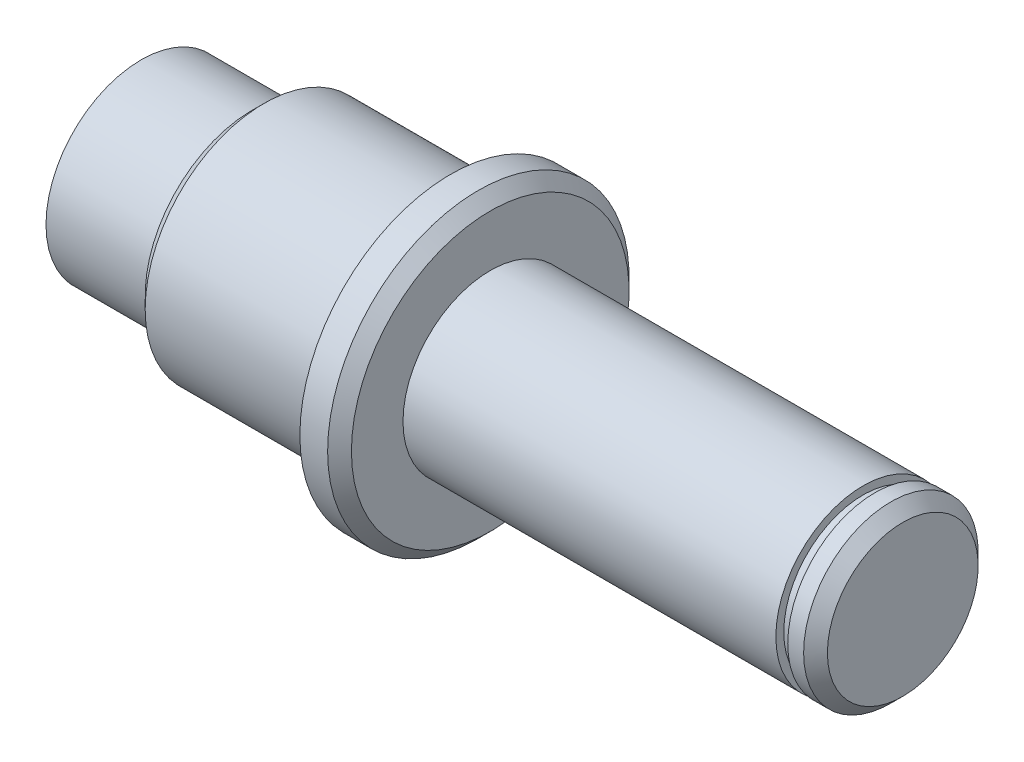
ISO-10303-21;
HEADER;
FILE_DESCRIPTION(('STEP AP214'),'2;1');
FILE_NAME('part.step','',(''),(''),'','','');
FILE_SCHEMA(('AUTOMOTIVE_DESIGN { 1 0 10303 214 1 1 1 1 }'));
ENDSEC;
DATA;
#1=APPLICATION_CONTEXT('core data for automotive mechanical design processes');
#2=APPLICATION_PROTOCOL_DEFINITION('international standard','automotive_design',2000,#1);
#3=PRODUCT_CONTEXT('',#1,'mechanical');
#4=PRODUCT('Part','Part','',(#3));
#5=PRODUCT_RELATED_PRODUCT_CATEGORY('part','',(#4));
#6=PRODUCT_DEFINITION_FORMATION('','',#4);
#7=PRODUCT_DEFINITION_CONTEXT('part definition',#1,'design');
#8=PRODUCT_DEFINITION('design','',#6,#7);
#9=PRODUCT_DEFINITION_SHAPE('','',#8);
#10=(LENGTH_UNIT() NAMED_UNIT(*) SI_UNIT(.MILLI.,.METRE.));
#11=(NAMED_UNIT(*) PLANE_ANGLE_UNIT() SI_UNIT($,.RADIAN.));
#12=(NAMED_UNIT(*) SI_UNIT($,.STERADIAN.) SOLID_ANGLE_UNIT());
#13=UNCERTAINTY_MEASURE_WITH_UNIT(LENGTH_MEASURE(1.E-05),#10,'distance_accuracy_value','');
#14=(GEOMETRIC_REPRESENTATION_CONTEXT(3) GLOBAL_UNCERTAINTY_ASSIGNED_CONTEXT((#13)) GLOBAL_UNIT_ASSIGNED_CONTEXT((#10,
#11,#12)) REPRESENTATION_CONTEXT('',''));
#15=CARTESIAN_POINT('',(0.,0.,0.));
#16=DIRECTION('',(0.,0.,1.));
#17=DIRECTION('',(1.,0.,0.));
#18=AXIS2_PLACEMENT_3D('',#15,#16,#17);
#19=CARTESIAN_POINT('',(0.,0.,0.));
#20=DIRECTION('',(-1.,0.,0.));
#21=DIRECTION('',(0.,0.,1.));
#22=AXIS2_PLACEMENT_3D('',#19,#20,#21);
#23=CYLINDRICAL_SURFACE('',#22,11.);
#24=CARTESIAN_POINT('',(47.0000000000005,0.,0.));
#25=DIRECTION('',(-1.,0.,0.));
#26=DIRECTION('',(0.,0.,1.));
#27=AXIS2_PLACEMENT_3D('',#24,#25,#26);
#28=CIRCLE('',#27,11.);
#29=CARTESIAN_POINT('',(47.0000000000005,0.,11.));
#30=VERTEX_POINT('',#29);
#31=EDGE_CURVE('E119',#30,#30,#28,.T.);
#32=ORIENTED_EDGE('',*,*,#31,.F.);
#33=EDGE_LOOP('',(#32));
#34=FACE_BOUND('',#33,.T.);
#35=CARTESIAN_POINT('',(94.0000000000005,0.,0.));
#36=DIRECTION('',(-1.,0.,0.));
#37=DIRECTION('',(0.,0.,1.));
#38=AXIS2_PLACEMENT_3D('',#35,#36,#37);
#39=CIRCLE('',#38,11.);
#40=CARTESIAN_POINT('',(94.0000000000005,0.,11.));
#41=VERTEX_POINT('',#40);
#42=EDGE_CURVE('E120',#41,#41,#39,.T.);
#43=ORIENTED_EDGE('',*,*,#42,.T.);
#44=EDGE_LOOP('',(#43));
#45=FACE_BOUND('',#44,.T.);
#46=CARTESIAN_POINT('',(60.0000000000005,-10.5830052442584,-2.99999999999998));
#47=CARTESIAN_POINT('',(60.1651129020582,-10.583007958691,-2.99999631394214));
#48=CARTESIAN_POINT('',(60.3302642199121,-10.5869115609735,-2.98632243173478));
#49=CARTESIAN_POINT('',(60.6557870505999,-10.6020548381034,-2.93209821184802));
#50=CARTESIAN_POINT('',(60.8161562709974,-10.6132979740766,-2.89153519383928));
#51=CARTESIAN_POINT('',(61.1273583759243,-10.6417543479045,-2.78497349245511));
#52=CARTESIAN_POINT('',(61.278204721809,-10.6589589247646,-2.71901169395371));
#53=CARTESIAN_POINT('',(61.5667162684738,-10.6973885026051,-2.56364148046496));
#54=CARTESIAN_POINT('',(61.7043802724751,-10.7186138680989,-2.47423093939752));
#55=CARTESIAN_POINT('',(61.9662204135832,-10.7633157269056,-2.27199971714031));
#56=CARTESIAN_POINT('',(62.0900006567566,-10.786833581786,-2.15867548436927));
#57=CARTESIAN_POINT('',(62.3170553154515,-10.8331142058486,-1.91291605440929));
#58=CARTESIAN_POINT('',(62.4203275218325,-10.8558768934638,-1.78047880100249));
#59=CARTESIAN_POINT('',(62.6050972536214,-10.898545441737,-1.49749518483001));
#60=CARTESIAN_POINT('',(62.6861994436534,-10.9183968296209,-1.34668176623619));
#61=CARTESIAN_POINT('',(62.8217457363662,-10.9525304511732,-1.03292742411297));
#62=CARTESIAN_POINT('',(62.8761945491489,-10.9668136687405,-0.869988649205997));
#63=CARTESIAN_POINT('',(62.9556021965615,-10.9879091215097,-0.540742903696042));
#64=CARTESIAN_POINT('',(62.9812348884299,-10.994891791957,-0.374609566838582));
#65=CARTESIAN_POINT('',(63.0044046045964,-11.0011960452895,-0.040263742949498));
#66=CARTESIAN_POINT('',(63.0019465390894,-11.0005189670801,0.12794837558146));
#67=CARTESIAN_POINT('',(62.9694752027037,-10.9917041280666,0.456980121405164));
#68=CARTESIAN_POINT('',(62.940190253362,-10.9837635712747,0.617877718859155));
#69=CARTESIAN_POINT('',(62.8560753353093,-10.9615478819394,0.932382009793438));
#70=CARTESIAN_POINT('',(62.8012438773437,-10.9472723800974,1.08598827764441));
#71=CARTESIAN_POINT('',(62.6670457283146,-10.9137017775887,1.38338647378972));
#72=CARTESIAN_POINT('',(62.5874331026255,-10.8943566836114,1.52706155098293));
#73=CARTESIAN_POINT('',(62.4061222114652,-10.852725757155,1.79925853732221));
#74=CARTESIAN_POINT('',(62.3044194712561,-10.830439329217,1.92777736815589));
#75=CARTESIAN_POINT('',(62.0779640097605,-10.784492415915,2.17036149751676));
#76=CARTESIAN_POINT('',(61.9525766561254,-10.7608107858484,2.2838310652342));
#77=CARTESIAN_POINT('',(61.6843095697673,-10.7153839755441,2.48828152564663));
#78=CARTESIAN_POINT('',(61.5414286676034,-10.6936389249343,2.5792609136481));
#79=CARTESIAN_POINT('',(61.2408912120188,-10.6544594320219,2.73663009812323));
#80=CARTESIAN_POINT('',(61.0831419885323,-10.6370548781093,2.8028508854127));
#81=CARTESIAN_POINT('',(60.7581547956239,-10.6088947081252,2.9076329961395));
#82=CARTESIAN_POINT('',(60.5909193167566,-10.5981373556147,2.94620154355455));
#83=CARTESIAN_POINT('',(60.257295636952,-10.5848615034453,2.99354252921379));
#84=CARTESIAN_POINT('',(60.0910436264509,-10.5820965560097,3.00320658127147));
#85=CARTESIAN_POINT('',(59.7592977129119,-10.5844430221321,2.99492665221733));
#86=CARTESIAN_POINT('',(59.5938037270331,-10.5895535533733,2.97698576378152));
#87=CARTESIAN_POINT('',(59.2717551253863,-10.6068364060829,2.91479275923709));
#88=CARTESIAN_POINT('',(59.1150871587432,-10.6188630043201,2.87108313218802));
#89=CARTESIAN_POINT('',(58.811307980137,-10.6484790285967,2.75920663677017));
#90=CARTESIAN_POINT('',(58.6641980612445,-10.6660692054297,2.69103646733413));
#91=CARTESIAN_POINT('',(58.3799985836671,-10.7053313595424,2.53038481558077));
#92=CARTESIAN_POINT('',(58.2432148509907,-10.7270874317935,2.43738334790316));
#93=CARTESIAN_POINT('',(57.9868678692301,-10.7720352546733,2.23034883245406));
#94=CARTESIAN_POINT('',(57.8673080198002,-10.7952272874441,2.1163116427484));
#95=CARTESIAN_POINT('',(57.6450672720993,-10.8412873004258,1.86630672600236));
#96=CARTESIAN_POINT('',(57.5430099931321,-10.8641239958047,1.72977769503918));
#97=CARTESIAN_POINT('',(57.3632587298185,-10.9061791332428,1.44101111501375));
#98=CARTESIAN_POINT('',(57.2855634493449,-10.9253977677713,1.28877440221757));
#99=CARTESIAN_POINT('',(57.1574658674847,-10.9579274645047,0.973984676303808));
#100=CARTESIAN_POINT('',(57.1068582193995,-10.9712828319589,0.81152002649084));
#101=CARTESIAN_POINT('',(57.0337860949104,-10.9907764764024,0.479971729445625));
#102=CARTESIAN_POINT('',(57.0113150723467,-10.9969164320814,0.310889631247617));
#103=CARTESIAN_POINT('',(56.9955797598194,-11.0012041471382,-0.0232794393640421));
#104=CARTESIAN_POINT('',(57.0014026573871,-10.9996016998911,-0.188320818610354));
#105=CARTESIAN_POINT('',(57.0399595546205,-10.9891537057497,-0.514982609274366));
#106=CARTESIAN_POINT('',(57.0726924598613,-10.980308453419,-0.676603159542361));
#107=CARTESIAN_POINT('',(57.1636147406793,-10.9564222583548,-0.99068406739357));
#108=CARTESIAN_POINT('',(57.2216113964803,-10.9414282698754,-1.14320402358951));
#109=CARTESIAN_POINT('',(57.3612432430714,-10.9068088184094,-1.43643473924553));
#110=CARTESIAN_POINT('',(57.4428818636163,-10.8871826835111,-1.57714378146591));
#111=CARTESIAN_POINT('',(57.6301094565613,-10.8447157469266,-1.84697735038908));
#112=CARTESIAN_POINT('',(57.7362981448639,-10.821801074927,-1.97567408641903));
#113=CARTESIAN_POINT('',(57.9684842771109,-10.77562687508,-2.21372992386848));
#114=CARTESIAN_POINT('',(58.0944870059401,-10.7523672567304,-2.32308384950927));
#115=CARTESIAN_POINT('',(58.3662550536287,-10.7075101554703,-2.52187932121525));
#116=CARTESIAN_POINT('',(58.5124124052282,-10.685964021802,-2.61079759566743));
#117=CARTESIAN_POINT('',(58.8181718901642,-10.6477131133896,-2.76267612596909));
#118=CARTESIAN_POINT('',(58.9777655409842,-10.6310053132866,-2.82565261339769));
#119=CARTESIAN_POINT('',(59.2805360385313,-10.6065296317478,-2.91605222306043));
#120=CARTESIAN_POINT('',(59.4224569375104,-10.5977813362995,-2.94745662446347));
#121=CARTESIAN_POINT('',(59.709575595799,-10.5860183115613,-2.98943081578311));
#122=CARTESIAN_POINT('',(59.8547729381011,-10.5830028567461,-3.00000324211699));
#123=CARTESIAN_POINT('',(60.0000000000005,-10.5830052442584,-2.99999999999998));
#124=B_SPLINE_CURVE_WITH_KNOTS('',3,(#46,#47,#48,#49,#50,#51,#52,#53,#54,#55,#56,#57,#58,#59,
#60,#61,#62,#63,#64,#65,#66,#67,#68,#69,#70,#71,#72,#73,#74,#75,#76,#77,#78,#79,#80,#81,#82,#83,
#84,#85,#86,#87,#88,#89,#90,#91,#92,#93,#94,#95,#96,#97,#98,#99,#100,#101,#102,#103,#104,#105,
#106,#107,#108,#109,#110,#111,#112,#113,#114,#115,#116,#117,#118,#119,#120,#121,#122,#123),
.UNSPECIFIED.,.T.,.F.,(4,2,2,2,2,2,2,2,2,2,2,2,2,2,2,2,2,2,2,2,2,2,2,2,2,2,2,2,2,2,2,2,2,2,2,2,
2,2,4),(0.,0.494804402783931,0.989842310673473,1.48416400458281,1.97853053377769,
2.48458654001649,2.99069702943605,3.50531765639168,4.0198473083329,4.52207686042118,
5.02421862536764,5.51311924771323,6.00204837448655,6.4959933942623,6.99003856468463,
7.4999283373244,8.00985221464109,8.52319603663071,9.03640570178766,9.53361223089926,
10.0307630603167,10.5178037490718,11.004910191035,11.5031485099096,12.0014850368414,
12.514971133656,13.0284299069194,13.5379390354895,14.0473296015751,14.5403975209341,
15.033445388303,15.5227962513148,16.0122181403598,16.5151701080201,17.0182564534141,
17.5330636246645,18.0475481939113,18.4828145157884,18.9180257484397),.UNSPECIFIED.);
#125=CARTESIAN_POINT('',(60.0000000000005,-10.5830052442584,2.99999999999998));
#126=VERTEX_POINT('',#125);
#127=CARTESIAN_POINT('',(60.0000000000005,-10.5830052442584,-2.99999999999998));
#128=VERTEX_POINT('',#127);
#129=EDGE_CURVE('E85',#126,#128,#124,.T.);
#130=ORIENTED_EDGE('',*,*,#129,.F.);
#131=DIRECTION('',(-1.,0.,0.));
#132=VECTOR('',#131,1.);
#133=CARTESIAN_POINT('',(0.,-10.5830052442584,2.99999999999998));
#134=LINE('',#133,#132);
#135=CARTESIAN_POINT('',(86.0000000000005,-10.5830052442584,2.99999999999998));
#136=VERTEX_POINT('',#135);
#137=EDGE_CURVE('E90',#136,#126,#134,.T.);
#138=ORIENTED_EDGE('',*,*,#137,.F.);
#139=CARTESIAN_POINT('',(86.0000000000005,-10.5830052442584,-2.99999999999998));
#140=CARTESIAN_POINT('',(86.1651129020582,-10.583007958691,-2.99999631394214));
#141=CARTESIAN_POINT('',(86.3302642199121,-10.5869115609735,-2.98632243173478));
#142=CARTESIAN_POINT('',(86.6557870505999,-10.6020548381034,-2.93209821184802));
#143=CARTESIAN_POINT('',(86.8161562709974,-10.6132979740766,-2.89153519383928));
#144=CARTESIAN_POINT('',(87.1273583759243,-10.6417543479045,-2.78497349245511));
#145=CARTESIAN_POINT('',(87.278204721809,-10.6589589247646,-2.71901169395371));
#146=CARTESIAN_POINT('',(87.5667162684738,-10.6973885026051,-2.56364148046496));
#147=CARTESIAN_POINT('',(87.704380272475,-10.7186138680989,-2.47423093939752));
#148=CARTESIAN_POINT('',(87.9662204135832,-10.7633157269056,-2.27199971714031));
#149=CARTESIAN_POINT('',(88.0900006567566,-10.786833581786,-2.15867548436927));
#150=CARTESIAN_POINT('',(88.3170553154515,-10.8331142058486,-1.91291605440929));
#151=CARTESIAN_POINT('',(88.4203275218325,-10.8558768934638,-1.7804788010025));
#152=CARTESIAN_POINT('',(88.6050972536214,-10.898545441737,-1.49749518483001));
#153=CARTESIAN_POINT('',(88.6861994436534,-10.9183968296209,-1.34668176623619));
#154=CARTESIAN_POINT('',(88.8217457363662,-10.9525304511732,-1.03292742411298));
#155=CARTESIAN_POINT('',(88.8761945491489,-10.9668136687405,-0.869988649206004));
#156=CARTESIAN_POINT('',(88.9556021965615,-10.9879091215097,-0.54074290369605));
#157=CARTESIAN_POINT('',(88.9812348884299,-10.994891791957,-0.374609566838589));
#158=CARTESIAN_POINT('',(89.0044046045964,-11.0011960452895,-0.0402637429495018));
#159=CARTESIAN_POINT('',(89.0019465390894,-11.0005189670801,0.127948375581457));
#160=CARTESIAN_POINT('',(88.9694752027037,-10.9917041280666,0.45698012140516));
#161=CARTESIAN_POINT('',(88.940190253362,-10.9837635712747,0.617877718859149));
#162=CARTESIAN_POINT('',(88.8560753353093,-10.9615478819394,0.93238200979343));
#163=CARTESIAN_POINT('',(88.8012438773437,-10.9472723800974,1.0859882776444));
#164=CARTESIAN_POINT('',(88.6670457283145,-10.9137017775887,1.38338647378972));
#165=CARTESIAN_POINT('',(88.5874331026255,-10.8943566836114,1.52706155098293));
#166=CARTESIAN_POINT('',(88.4061222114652,-10.852725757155,1.79925853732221));
#167=CARTESIAN_POINT('',(88.3044194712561,-10.830439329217,1.92777736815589));
#168=CARTESIAN_POINT('',(88.0779640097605,-10.784492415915,2.17036149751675));
#169=CARTESIAN_POINT('',(87.9525766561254,-10.7608107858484,2.2838310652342));
#170=CARTESIAN_POINT('',(87.6843095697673,-10.7153839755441,2.48828152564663));
#171=CARTESIAN_POINT('',(87.5414286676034,-10.6936389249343,2.5792609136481));
#172=CARTESIAN_POINT('',(87.2408912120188,-10.6544594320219,2.73663009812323));
#173=CARTESIAN_POINT('',(87.0831419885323,-10.6370548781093,2.8028508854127));
#174=CARTESIAN_POINT('',(86.7581547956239,-10.6088947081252,2.9076329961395));
#175=CARTESIAN_POINT('',(86.5909193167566,-10.5981373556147,2.94620154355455));
#176=CARTESIAN_POINT('',(86.257295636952,-10.5848615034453,2.99354252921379));
#177=CARTESIAN_POINT('',(86.0910436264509,-10.5820965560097,3.00320658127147));
#178=CARTESIAN_POINT('',(85.7592977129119,-10.5844430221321,2.99492665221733));
#179=CARTESIAN_POINT('',(85.5938037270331,-10.5895535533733,2.97698576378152));
#180=CARTESIAN_POINT('',(85.2717551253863,-10.6068364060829,2.91479275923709));
#181=CARTESIAN_POINT('',(85.1150871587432,-10.6188630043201,2.87108313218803));
#182=CARTESIAN_POINT('',(84.811307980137,-10.6484790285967,2.75920663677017));
#183=CARTESIAN_POINT('',(84.6641980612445,-10.6660692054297,2.69103646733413));
#184=CARTESIAN_POINT('',(84.3799985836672,-10.7053313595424,2.53038481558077));
#185=CARTESIAN_POINT('',(84.2432148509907,-10.7270874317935,2.43738334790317));
#186=CARTESIAN_POINT('',(83.9868678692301,-10.7720352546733,2.23034883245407));
#187=CARTESIAN_POINT('',(83.8673080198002,-10.7952272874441,2.11631164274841));
#188=CARTESIAN_POINT('',(83.6450672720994,-10.8412873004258,1.86630672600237));
#189=CARTESIAN_POINT('',(83.5430099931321,-10.8641239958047,1.72977769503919));
#190=CARTESIAN_POINT('',(83.3632587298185,-10.9061791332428,1.44101111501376));
#191=CARTESIAN_POINT('',(83.2855634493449,-10.9253977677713,1.28877440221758));
#192=CARTESIAN_POINT('',(83.1574658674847,-10.9579274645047,0.973984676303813));
#193=CARTESIAN_POINT('',(83.1068582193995,-10.9712828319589,0.81152002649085));
#194=CARTESIAN_POINT('',(83.0337860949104,-10.9907764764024,0.479971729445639));
#195=CARTESIAN_POINT('',(83.0113150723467,-10.9969164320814,0.31088963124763));
#196=CARTESIAN_POINT('',(82.9955797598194,-11.0012041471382,-0.0232794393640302));
#197=CARTESIAN_POINT('',(83.001402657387,-10.9996016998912,-0.188320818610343));
#198=CARTESIAN_POINT('',(83.0399595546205,-10.9891537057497,-0.514982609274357));
#199=CARTESIAN_POINT('',(83.0726924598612,-10.980308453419,-0.676603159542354));
#200=CARTESIAN_POINT('',(83.1636147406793,-10.9564222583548,-0.990684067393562));
#201=CARTESIAN_POINT('',(83.2216113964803,-10.9414282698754,-1.1432040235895));
#202=CARTESIAN_POINT('',(83.3612432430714,-10.9068088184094,-1.43643473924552));
#203=CARTESIAN_POINT('',(83.4428818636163,-10.8871826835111,-1.57714378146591));
#204=CARTESIAN_POINT('',(83.6301094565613,-10.8447157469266,-1.84697735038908));
#205=CARTESIAN_POINT('',(83.7362981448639,-10.821801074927,-1.97567408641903));
#206=CARTESIAN_POINT('',(83.9684842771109,-10.77562687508,-2.21372992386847));
#207=CARTESIAN_POINT('',(84.0944870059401,-10.7523672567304,-2.32308384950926));
#208=CARTESIAN_POINT('',(84.3662550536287,-10.7075101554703,-2.52187932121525));
#209=CARTESIAN_POINT('',(84.5124124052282,-10.685964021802,-2.61079759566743));
#210=CARTESIAN_POINT('',(84.8181718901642,-10.6477131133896,-2.76267612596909));
#211=CARTESIAN_POINT('',(84.9777655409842,-10.6310053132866,-2.82565261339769));
#212=CARTESIAN_POINT('',(85.2805360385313,-10.6065296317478,-2.91605222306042));
#213=CARTESIAN_POINT('',(85.4224569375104,-10.5977813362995,-2.94745662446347));
#214=CARTESIAN_POINT('',(85.709575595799,-10.5860183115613,-2.98943081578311));
#215=CARTESIAN_POINT('',(85.8547729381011,-10.5830028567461,-3.00000324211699));
#216=CARTESIAN_POINT('',(86.0000000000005,-10.5830052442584,-2.99999999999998));
#217=B_SPLINE_CURVE_WITH_KNOTS('',3,(#139,#140,#141,#142,#143,#144,#145,#146,#147,#148,#149,
#150,#151,#152,#153,#154,#155,#156,#157,#158,#159,#160,#161,#162,#163,#164,#165,#166,#167,#168,
#169,#170,#171,#172,#173,#174,#175,#176,#177,#178,#179,#180,#181,#182,#183,#184,#185,#186,#187,
#188,#189,#190,#191,#192,#193,#194,#195,#196,#197,#198,#199,#200,#201,#202,#203,#204,#205,#206,
#207,#208,#209,#210,#211,#212,#213,#214,#215,#216),.UNSPECIFIED.,.T.,.F.,(4,2,2,2,2,2,2,2,2,2,2,
2,2,2,2,2,2,2,2,2,2,2,2,2,2,2,2,2,2,2,2,2,2,2,2,2,2,2,4),(0.,0.494804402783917,
0.989842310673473,1.48416400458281,1.97853053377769,2.48458654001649,2.99069702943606,
3.50531765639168,4.01984730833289,4.52207686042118,5.02421862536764,5.51311924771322,
6.00204837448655,6.4959933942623,6.99003856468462,7.49992833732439,8.00985221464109,
8.52319603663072,9.03640570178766,9.53361223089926,10.0307630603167,10.5178037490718,
11.004910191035,11.5031485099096,12.0014850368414,12.514971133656,13.0284299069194,
13.5379390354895,14.0473296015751,14.5403975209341,15.033445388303,15.5227962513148,
16.0122181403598,16.5151701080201,17.0182564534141,17.5330636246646,18.0475481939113,
18.4828145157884,18.9180257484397),.UNSPECIFIED.);
#218=CARTESIAN_POINT('',(86.0000000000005,-10.5830052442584,-2.99999999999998));
#219=VERTEX_POINT('',#218);
#220=EDGE_CURVE('E98',#219,#136,#217,.T.);
#221=ORIENTED_EDGE('',*,*,#220,.F.);
#222=DIRECTION('',(-1.,0.,0.));
#223=VECTOR('',#222,1.);
#224=CARTESIAN_POINT('',(0.,-10.5830052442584,-2.99999999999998));
#225=LINE('',#224,#223);
#226=EDGE_CURVE('E79',#128,#219,#225,.F.);
#227=ORIENTED_EDGE('',*,*,#226,.F.);
#228=EDGE_LOOP('',(#130,#138,#221,#227));
#229=FACE_BOUND('',#228,.T.);
#230=ADVANCED_FACE('F29',(#34,#45,#229),#23,.T.);
#231=CARTESIAN_POINT('',(17.0000000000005,15.,0.));
#232=DIRECTION('',(1.,0.,0.));
#233=DIRECTION('',(0.,0.,-1.));
#234=AXIS2_PLACEMENT_3D('',#231,#232,#233);
#235=PLANE('',#234);
#236=CARTESIAN_POINT('',(17.0000000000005,0.,0.));
#237=DIRECTION('',(1.,0.,0.));
#238=DIRECTION('',(0.,0.,-1.));
#239=AXIS2_PLACEMENT_3D('',#236,#237,#238);
#240=CIRCLE('',#239,13.5);
#241=CARTESIAN_POINT('',(17.0000000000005,0.,-13.5));
#242=VERTEX_POINT('',#241);
#243=EDGE_CURVE('E123',#242,#242,#240,.F.);
#244=ORIENTED_EDGE('',*,*,#243,.T.);
#245=EDGE_LOOP('',(#244));
#246=FACE_BOUND('',#245,.T.);
#247=CARTESIAN_POINT('',(17.0000000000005,0.,0.));
#248=DIRECTION('',(-1.,0.,0.));
#249=DIRECTION('',(0.,0.,1.));
#250=AXIS2_PLACEMENT_3D('',#247,#248,#249);
#251=CIRCLE('',#250,11.9999999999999);
#252=CARTESIAN_POINT('',(17.0000000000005,0.,11.9999999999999));
#253=VERTEX_POINT('',#252);
#254=EDGE_CURVE('E99',#253,#253,#251,.T.);
#255=ORIENTED_EDGE('',*,*,#254,.F.);
#256=EDGE_LOOP('',(#255));
#257=FACE_BOUND('',#256,.T.);
#258=ADVANCED_FACE('F169',(#246,#257),#235,.F.);
#259=CARTESIAN_POINT('',(0.,0.,0.));
#260=DIRECTION('',(-1.,0.,0.));
#261=DIRECTION('',(0.,0.,1.));
#262=AXIS2_PLACEMENT_3D('',#259,#260,#261);
#263=CYLINDRICAL_SURFACE('',#262,15.);
#264=CARTESIAN_POINT('',(18.5000000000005,0.,0.));
#265=DIRECTION('',(1.,0.,0.));
#266=DIRECTION('',(0.,0.,-1.));
#267=AXIS2_PLACEMENT_3D('',#264,#265,#266);
#268=CIRCLE('',#267,15.);
#269=CARTESIAN_POINT('',(18.5000000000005,0.,-15.));
#270=VERTEX_POINT('',#269);
#271=EDGE_CURVE('E134',#270,#270,#268,.T.);
#272=ORIENTED_EDGE('',*,*,#271,.T.);
#273=EDGE_LOOP('',(#272));
#274=FACE_BOUND('',#273,.T.);
#275=CARTESIAN_POINT('',(42.0000000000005,0.,0.));
#276=DIRECTION('',(-1.,0.,0.));
#277=DIRECTION('',(0.,0.,1.));
#278=AXIS2_PLACEMENT_3D('',#275,#276,#277);
#279=CIRCLE('',#278,15.);
#280=CARTESIAN_POINT('',(42.0000000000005,0.,15.));
#281=VERTEX_POINT('',#280);
#282=EDGE_CURVE('E131',#281,#281,#279,.T.);
#283=ORIENTED_EDGE('',*,*,#282,.T.);
#284=EDGE_LOOP('',(#283));
#285=FACE_BOUND('',#284,.T.);
#286=ADVANCED_FACE('F174',(#274,#285),#263,.T.);
#287=CARTESIAN_POINT('',(42.0000000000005,15.,0.));
#288=DIRECTION('',(1.,0.,0.));
#289=DIRECTION('',(0.,0.,-1.));
#290=AXIS2_PLACEMENT_3D('',#287,#288,#289);
#291=PLANE('',#290);
#292=ORIENTED_EDGE('',*,*,#282,.F.);
#293=EDGE_LOOP('',(#292));
#294=FACE_BOUND('',#293,.T.);
#295=CARTESIAN_POINT('',(42.0000000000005,0.,0.));
#296=DIRECTION('',(-1.,0.,0.));
#297=DIRECTION('',(0.,0.,1.));
#298=AXIS2_PLACEMENT_3D('',#295,#296,#297);
#299=CIRCLE('',#298,19.);
#300=CARTESIAN_POINT('',(42.0000000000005,0.,19.));
#301=VERTEX_POINT('',#300);
#302=EDGE_CURVE('E127',#301,#301,#299,.T.);
#303=ORIENTED_EDGE('',*,*,#302,.T.);
#304=EDGE_LOOP('',(#303));
#305=FACE_BOUND('',#304,.T.);
#306=ADVANCED_FACE('F248',(#294,#305),#291,.F.);
#307=CARTESIAN_POINT('',(0.,0.,0.));
#308=DIRECTION('',(-1.,0.,0.));
#309=DIRECTION('',(0.,0.,1.));
#310=AXIS2_PLACEMENT_3D('',#307,#308,#309);
#311=CYLINDRICAL_SURFACE('',#310,19.);
#312=CARTESIAN_POINT('',(45.5000000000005,0.,0.));
#313=DIRECTION('',(-1.,0.,0.));
#314=DIRECTION('',(0.,0.,1.));
#315=AXIS2_PLACEMENT_3D('',#312,#313,#314);
#316=CIRCLE('',#315,19.);
#317=CARTESIAN_POINT('',(45.5000000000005,0.,19.));
#318=VERTEX_POINT('',#317);
#319=EDGE_CURVE('E130',#318,#318,#316,.T.);
#320=ORIENTED_EDGE('',*,*,#319,.T.);
#321=EDGE_LOOP('',(#320));
#322=FACE_BOUND('',#321,.T.);
#323=ORIENTED_EDGE('',*,*,#302,.F.);
#324=EDGE_LOOP('',(#323));
#325=FACE_BOUND('',#324,.T.);
#326=ADVANCED_FACE('F236',(#322,#325),#311,.T.);
#327=CARTESIAN_POINT('',(47.0000000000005,19.,0.));
#328=DIRECTION('',(-1.,0.,0.));
#329=DIRECTION('',(0.,0.,1.));
#330=AXIS2_PLACEMENT_3D('',#327,#328,#329);
#331=PLANE('',#330);
#332=CARTESIAN_POINT('',(47.0000000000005,0.,0.));
#333=DIRECTION('',(-1.,0.,0.));
#334=DIRECTION('',(0.,0.,1.));
#335=AXIS2_PLACEMENT_3D('',#332,#333,#334);
#336=CIRCLE('',#335,17.5);
#337=CARTESIAN_POINT('',(47.0000000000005,0.,17.5));
#338=VERTEX_POINT('',#337);
#339=EDGE_CURVE('E126',#338,#338,#336,.F.);
#340=ORIENTED_EDGE('',*,*,#339,.T.);
#341=EDGE_LOOP('',(#340));
#342=FACE_BOUND('',#341,.T.);
#343=ORIENTED_EDGE('',*,*,#31,.T.);
#344=EDGE_LOOP('',(#343));
#345=FACE_BOUND('',#344,.T.);
#346=ADVANCED_FACE('F231',(#342,#345),#331,.F.);
#347=CARTESIAN_POINT('',(94.0000000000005,11.,0.));
#348=DIRECTION('',(-1.,0.,0.));
#349=DIRECTION('',(0.,0.,1.));
#350=AXIS2_PLACEMENT_3D('',#347,#348,#349);
#351=PLANE('',#350);
#352=ORIENTED_EDGE('',*,*,#42,.F.);
#353=EDGE_LOOP('',(#352));
#354=FACE_BOUND('',#353,.T.);
#355=CARTESIAN_POINT('',(94.0000000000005,0.,0.));
#356=DIRECTION('',(-1.,0.,0.));
#357=DIRECTION('',(0.,0.,1.));
#358=AXIS2_PLACEMENT_3D('',#355,#356,#357);
#359=CIRCLE('',#358,10.);
#360=CARTESIAN_POINT('',(94.0000000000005,0.,10.));
#361=VERTEX_POINT('',#360);
#362=EDGE_CURVE('E116',#361,#361,#359,.T.);
#363=ORIENTED_EDGE('',*,*,#362,.T.);
#364=EDGE_LOOP('',(#363));
#365=FACE_BOUND('',#364,.T.);
#366=ADVANCED_FACE('F228',(#354,#365),#351,.F.);
#367=CARTESIAN_POINT('',(0.,0.,0.));
#368=DIRECTION('',(-1.,0.,0.));
#369=DIRECTION('',(0.,0.,1.));
#370=AXIS2_PLACEMENT_3D('',#367,#368,#369);
#371=CYLINDRICAL_SURFACE('',#370,10.);
#372=ORIENTED_EDGE('',*,*,#362,.F.);
#373=EDGE_LOOP('',(#372));
#374=FACE_BOUND('',#373,.T.);
#375=CARTESIAN_POINT('',(95.5000000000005,0.,0.));
#376=DIRECTION('',(-1.,0.,0.));
#377=DIRECTION('',(0.,0.,1.));
#378=AXIS2_PLACEMENT_3D('',#375,#376,#377);
#379=CIRCLE('',#378,10.);
#380=CARTESIAN_POINT('',(95.5000000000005,0.,10.));
#381=VERTEX_POINT('',#380);
#382=EDGE_CURVE('E113',#381,#381,#379,.T.);
#383=ORIENTED_EDGE('',*,*,#382,.T.);
#384=EDGE_LOOP('',(#383));
#385=FACE_BOUND('',#384,.T.);
#386=ADVANCED_FACE('F225',(#374,#385),#371,.T.);
#387=CARTESIAN_POINT('',(95.5000000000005,10.,0.));
#388=DIRECTION('',(1.,0.,0.));
#389=DIRECTION('',(0.,0.,-1.));
#390=AXIS2_PLACEMENT_3D('',#387,#388,#389);
#391=PLANE('',#390);
#392=ORIENTED_EDGE('',*,*,#382,.F.);
#393=EDGE_LOOP('',(#392));
#394=FACE_BOUND('',#393,.T.);
#395=CARTESIAN_POINT('',(95.5000000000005,0.,0.));
#396=DIRECTION('',(-1.,0.,0.));
#397=DIRECTION('',(0.,0.,1.));
#398=AXIS2_PLACEMENT_3D('',#395,#396,#397);
#399=CIRCLE('',#398,11.);
#400=CARTESIAN_POINT('',(95.5000000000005,0.,11.));
#401=VERTEX_POINT('',#400);
#402=EDGE_CURVE('E109',#401,#401,#399,.T.);
#403=ORIENTED_EDGE('',*,*,#402,.T.);
#404=EDGE_LOOP('',(#403));
#405=FACE_BOUND('',#404,.T.);
#406=ADVANCED_FACE('F221',(#394,#405),#391,.F.);
#407=CARTESIAN_POINT('',(0.,0.,0.));
#408=DIRECTION('',(-1.,0.,0.));
#409=DIRECTION('',(0.,0.,1.));
#410=AXIS2_PLACEMENT_3D('',#407,#408,#409);
#411=CYLINDRICAL_SURFACE('',#410,11.);
#412=CARTESIAN_POINT('',(97.5000000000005,0.,0.));
#413=DIRECTION('',(-1.,0.,0.));
#414=DIRECTION('',(0.,0.,1.));
#415=AXIS2_PLACEMENT_3D('',#412,#413,#414);
#416=CIRCLE('',#415,11.);
#417=CARTESIAN_POINT('',(97.5000000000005,0.,11.));
#418=VERTEX_POINT('',#417);
#419=EDGE_CURVE('E112',#418,#418,#416,.T.);
#420=ORIENTED_EDGE('',*,*,#419,.T.);
#421=EDGE_LOOP('',(#420));
#422=FACE_BOUND('',#421,.T.);
#423=ORIENTED_EDGE('',*,*,#402,.F.);
#424=EDGE_LOOP('',(#423));
#425=FACE_BOUND('',#424,.T.);
#426=ADVANCED_FACE('F217',(#422,#425),#411,.T.);
#427=CARTESIAN_POINT('',(99.0000000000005,11.,0.));
#428=DIRECTION('',(-1.,0.,0.));
#429=DIRECTION('',(0.,0.,1.));
#430=AXIS2_PLACEMENT_3D('',#427,#428,#429);
#431=PLANE('',#430);
#432=CARTESIAN_POINT('',(99.0000000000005,0.,0.));
#433=DIRECTION('',(-1.,0.,0.));
#434=DIRECTION('',(0.,0.,1.));
#435=AXIS2_PLACEMENT_3D('',#432,#433,#434);
#436=CIRCLE('',#435,9.50000000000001);
#437=CARTESIAN_POINT('',(99.0000000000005,0.,9.50000000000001));
#438=VERTEX_POINT('',#437);
#439=EDGE_CURVE('E145',#438,#438,#436,.F.);
#440=ORIENTED_EDGE('',*,*,#439,.T.);
#441=EDGE_LOOP('',(#440));
#442=FACE_BOUND('',#441,.T.);
#443=ADVANCED_FACE('F213',(#442),#431,.F.);
#444=CARTESIAN_POINT('',(1.5000000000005,0.,0.));
#445=DIRECTION('',(-1.,0.,0.));
#446=DIRECTION('',(0.,0.,1.));
#447=AXIS2_PLACEMENT_3D('',#444,#445,#446);
#448=TOROIDAL_SURFACE('',#447,11.5,1.5);
#449=CARTESIAN_POINT('',(2.0000000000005,0.,0.));
#450=DIRECTION('',(-1.,0.,0.));
#451=DIRECTION('',(0.,-1.,0.));
#452=AXIS2_PLACEMENT_3D('',#449,#450,#451);
#453=CIRCLE('',#452,10.0857864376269);
#454=CARTESIAN_POINT('',(2.0000000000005,-10.0857864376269,0.));
#455=VERTEX_POINT('',#454);
#456=EDGE_CURVE('E108',#455,#455,#453,.F.);
#457=ORIENTED_EDGE('',*,*,#456,.T.);
#458=EDGE_LOOP('',(#457));
#459=FACE_BOUND('',#458,.T.);
#460=CARTESIAN_POINT('',(3.0000000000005,0.,0.));
#461=DIRECTION('',(-1.,0.,0.));
#462=DIRECTION('',(0.,0.,1.));
#463=AXIS2_PLACEMENT_3D('',#460,#461,#462);
#464=CIRCLE('',#463,11.5);
#465=CARTESIAN_POINT('',(3.0000000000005,0.,11.5));
#466=VERTEX_POINT('',#465);
#467=EDGE_CURVE('E105',#466,#466,#464,.T.);
#468=ORIENTED_EDGE('',*,*,#467,.T.);
#469=EDGE_LOOP('',(#468));
#470=FACE_BOUND('',#469,.T.);
#471=ADVANCED_FACE('F209',(#459,#470),#448,.F.);
#472=CARTESIAN_POINT('',(3.0000000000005,11.9999999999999,0.));
#473=DIRECTION('',(1.,0.,0.));
#474=DIRECTION('',(0.,0.,-1.));
#475=AXIS2_PLACEMENT_3D('',#472,#473,#474);
#476=PLANE('',#475);
#477=ORIENTED_EDGE('',*,*,#467,.F.);
#478=EDGE_LOOP('',(#477));
#479=FACE_BOUND('',#478,.T.);
#480=CARTESIAN_POINT('',(3.0000000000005,0.,0.));
#481=DIRECTION('',(-1.,0.,0.));
#482=DIRECTION('',(0.,0.,1.));
#483=AXIS2_PLACEMENT_3D('',#480,#481,#482);
#484=CIRCLE('',#483,11.9999999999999);
#485=CARTESIAN_POINT('',(3.0000000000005,0.,11.9999999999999));
#486=VERTEX_POINT('',#485);
#487=EDGE_CURVE('E102',#486,#486,#484,.T.);
#488=ORIENTED_EDGE('',*,*,#487,.T.);
#489=EDGE_LOOP('',(#488));
#490=FACE_BOUND('',#489,.T.);
#491=ADVANCED_FACE('F205',(#479,#490),#476,.F.);
#492=CARTESIAN_POINT('',(0.,0.,0.));
#493=DIRECTION('',(-1.,0.,0.));
#494=DIRECTION('',(0.,0.,1.));
#495=AXIS2_PLACEMENT_3D('',#492,#493,#494);
#496=CYLINDRICAL_SURFACE('',#495,11.9999999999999);
#497=ORIENTED_EDGE('',*,*,#487,.F.);
#498=EDGE_LOOP('',(#497));
#499=FACE_BOUND('',#498,.T.);
#500=ORIENTED_EDGE('',*,*,#254,.T.);
#501=EDGE_LOOP('',(#500));
#502=FACE_BOUND('',#501,.T.);
#503=ADVANCED_FACE('F201',(#499,#502),#496,.T.);
#504=CARTESIAN_POINT('',(17.0000000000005,0.,0.));
#505=DIRECTION('',(1.,0.,0.));
#506=DIRECTION('',(0.,0.,-1.));
#507=AXIS2_PLACEMENT_3D('',#504,#505,#506);
#508=CONICAL_SURFACE('',#507,13.5,0.785398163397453);
#509=CARTESIAN_POINT('',(18.5000000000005,0.,-15.));
#510=CARTESIAN_POINT('',(18.4843750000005,0.,-14.984375));
#511=CARTESIAN_POINT('',(18.4687500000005,0.,-14.96875));
#512=CARTESIAN_POINT('',(18.4375000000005,0.,-14.9375));
#513=CARTESIAN_POINT('',(18.4218750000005,0.,-14.921875));
#514=CARTESIAN_POINT('',(18.3906250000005,0.,-14.890625));
#515=CARTESIAN_POINT('',(18.3750000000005,0.,-14.875));
#516=CARTESIAN_POINT('',(18.3437500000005,0.,-14.84375));
#517=CARTESIAN_POINT('',(18.3281250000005,0.,-14.828125));
#518=CARTESIAN_POINT('',(18.2968750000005,0.,-14.796875));
#519=CARTESIAN_POINT('',(18.2812500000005,0.,-14.78125));
#520=CARTESIAN_POINT('',(18.2500000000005,0.,-14.75));
#521=CARTESIAN_POINT('',(18.2343750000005,0.,-14.734375));
#522=CARTESIAN_POINT('',(18.2031250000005,0.,-14.703125));
#523=CARTESIAN_POINT('',(18.1875000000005,0.,-14.6875));
#524=CARTESIAN_POINT('',(18.1562500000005,0.,-14.65625));
#525=CARTESIAN_POINT('',(18.1406250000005,0.,-14.640625));
#526=CARTESIAN_POINT('',(18.1093750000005,0.,-14.609375));
#527=CARTESIAN_POINT('',(18.0937500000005,0.,-14.59375));
#528=CARTESIAN_POINT('',(18.0625000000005,0.,-14.5625));
#529=CARTESIAN_POINT('',(18.0468750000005,0.,-14.546875));
#530=CARTESIAN_POINT('',(18.0156250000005,0.,-14.515625));
#531=CARTESIAN_POINT('',(18.0000000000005,0.,-14.5));
#532=CARTESIAN_POINT('',(17.9687500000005,0.,-14.46875));
#533=CARTESIAN_POINT('',(17.9531250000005,0.,-14.453125));
#534=CARTESIAN_POINT('',(17.9218750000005,0.,-14.421875));
#535=CARTESIAN_POINT('',(17.9062500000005,0.,-14.40625));
#536=CARTESIAN_POINT('',(17.8750000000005,0.,-14.375));
#537=CARTESIAN_POINT('',(17.8593750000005,0.,-14.359375));
#538=CARTESIAN_POINT('',(17.8281250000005,0.,-14.328125));
#539=CARTESIAN_POINT('',(17.8125000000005,0.,-14.3125));
#540=CARTESIAN_POINT('',(17.7812500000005,0.,-14.28125));
#541=CARTESIAN_POINT('',(17.7656250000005,0.,-14.265625));
#542=CARTESIAN_POINT('',(17.7343750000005,0.,-14.234375));
#543=CARTESIAN_POINT('',(17.7187500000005,0.,-14.21875));
#544=CARTESIAN_POINT('',(17.6875000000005,0.,-14.1875));
#545=CARTESIAN_POINT('',(17.6718750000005,0.,-14.171875));
#546=CARTESIAN_POINT('',(17.6406250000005,0.,-14.140625));
#547=CARTESIAN_POINT('',(17.6250000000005,0.,-14.125));
#548=CARTESIAN_POINT('',(17.5937500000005,0.,-14.09375));
#549=CARTESIAN_POINT('',(17.5781250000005,0.,-14.078125));
#550=CARTESIAN_POINT('',(17.5468750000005,0.,-14.046875));
#551=CARTESIAN_POINT('',(17.5312500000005,0.,-14.03125));
#552=CARTESIAN_POINT('',(17.5000000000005,0.,-14.));
#553=CARTESIAN_POINT('',(17.4843750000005,0.,-13.984375));
#554=CARTESIAN_POINT('',(17.4531250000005,0.,-13.953125));
#555=CARTESIAN_POINT('',(17.4375000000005,0.,-13.9375));
#556=CARTESIAN_POINT('',(17.4062500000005,0.,-13.90625));
#557=CARTESIAN_POINT('',(17.3906250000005,0.,-13.890625));
#558=CARTESIAN_POINT('',(17.3593750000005,0.,-13.859375));
#559=CARTESIAN_POINT('',(17.3437500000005,0.,-13.84375));
#560=CARTESIAN_POINT('',(17.3125000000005,0.,-13.8125));
#561=CARTESIAN_POINT('',(17.2968750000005,0.,-13.796875));
#562=CARTESIAN_POINT('',(17.2656250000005,0.,-13.765625));
#563=CARTESIAN_POINT('',(17.2500000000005,0.,-13.75));
#564=CARTESIAN_POINT('',(17.2187500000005,0.,-13.71875));
#565=CARTESIAN_POINT('',(17.2031250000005,0.,-13.703125));
#566=CARTESIAN_POINT('',(17.1718750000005,0.,-13.671875));
#567=CARTESIAN_POINT('',(17.1562500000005,0.,-13.65625));
#568=CARTESIAN_POINT('',(17.1250000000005,0.,-13.625));
#569=CARTESIAN_POINT('',(17.1093750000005,0.,-13.609375));
#570=CARTESIAN_POINT('',(17.0781250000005,0.,-13.578125));
#571=CARTESIAN_POINT('',(17.0625000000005,0.,-13.5625));
#572=CARTESIAN_POINT('',(17.0312500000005,0.,-13.53125));
#573=CARTESIAN_POINT('',(17.0156250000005,0.,-13.515625));
#574=CARTESIAN_POINT('',(17.0000000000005,0.,-13.5));
#575=B_SPLINE_CURVE_WITH_KNOTS('',3,(#509,#510,#511,#512,#513,#514,#515,#516,#517,#518,#519,
#520,#521,#522,#523,#524,#525,#526,#527,#528,#529,#530,#531,#532,#533,#534,#535,#536,#537,#538,
#539,#540,#541,#542,#543,#544,#545,#546,#547,#548,#549,#550,#551,#552,#553,#554,#555,#556,#557,
#558,#559,#560,#561,#562,#563,#564,#565,#566,#567,#568,#569,#570,#571,#572,#573,#574),
.UNSPECIFIED.,.F.,.F.,(4,2,2,2,2,2,2,2,2,2,2,2,2,2,2,2,2,2,2,2,2,2,2,2,2,2,2,2,2,2,2,2,4),(0.,
0.0662912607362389,0.13258252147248,0.19887378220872,0.265165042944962,0.331456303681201,
0.397747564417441,0.464038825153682,0.530330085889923,0.596621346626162,0.662912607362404,
0.729203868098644,0.795495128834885,0.861786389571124,0.928077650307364,0.994368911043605,
1.06066017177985,1.12695143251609,1.19324269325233,1.25953395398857,1.32582521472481,
1.39211647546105,1.45840773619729,1.52469899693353,1.59099025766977,1.65728151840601,
1.72357277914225,1.78986403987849,1.85615530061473,1.92244656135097,1.98873782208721,
2.05502908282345,2.12132034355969),.UNSPECIFIED.);
#576=EDGE_CURVE('BSEAM197',#270,#242,#575,.T.);
#577=ORIENTED_EDGE('',*,*,#271,.F.);
#578=ORIENTED_EDGE('',*,*,#243,.F.);
#579=ORIENTED_EDGE('',*,*,#576,.T.);
#580=ORIENTED_EDGE('',*,*,#576,.F.);
#581=EDGE_LOOP('',(#577,#579,#578,#580));
#582=FACE_BOUND('',#581,.T.);
#583=ADVANCED_FACE('F197',(#582),#508,.T.);
#584=CARTESIAN_POINT('',(45.5000000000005,0.,0.));
#585=DIRECTION('',(-1.,0.,0.));
#586=DIRECTION('',(0.,0.,1.));
#587=AXIS2_PLACEMENT_3D('',#584,#585,#586);
#588=CONICAL_SURFACE('',#587,19.,0.785398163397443);
#589=ORIENTED_EDGE('',*,*,#339,.F.);
#590=EDGE_LOOP('',(#589));
#591=FACE_BOUND('',#590,.T.);
#592=ORIENTED_EDGE('',*,*,#319,.F.);
#593=EDGE_LOOP('',(#592));
#594=FACE_BOUND('',#593,.T.);
#595=ADVANCED_FACE('F193',(#591,#594),#588,.T.);
#596=CARTESIAN_POINT('',(97.5000000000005,0.,0.));
#597=DIRECTION('',(-1.,0.,0.));
#598=DIRECTION('',(0.,0.,1.));
#599=AXIS2_PLACEMENT_3D('',#596,#597,#598);
#600=CONICAL_SURFACE('',#599,11.,0.785398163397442);
#601=ORIENTED_EDGE('',*,*,#439,.F.);
#602=EDGE_LOOP('',(#601));
#603=FACE_BOUND('',#602,.T.);
#604=ORIENTED_EDGE('',*,*,#419,.F.);
#605=EDGE_LOOP('',(#604));
#606=FACE_BOUND('',#605,.T.);
#607=ADVANCED_FACE('F190',(#603,#606),#600,.T.);
#608=CARTESIAN_POINT('',(86.0000000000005,-8.,0.));
#609=DIRECTION('',(0.,-1.,0.));
#610=DIRECTION('',(0.,0.,-1.));
#611=AXIS2_PLACEMENT_3D('',#608,#609,#610);
#612=CYLINDRICAL_SURFACE('',#611,2.99999999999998);
#613=DIRECTION('',(0.,-1.,0.));
#614=VECTOR('',#613,1.);
#615=CARTESIAN_POINT('',(86.0000000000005,-8.,-2.99999999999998));
#616=LINE('',#615,#614);
#617=CARTESIAN_POINT('',(86.0000000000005,-8.,-2.99999999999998));
#618=VERTEX_POINT('',#617);
#619=EDGE_CURVE('E78',#618,#219,#616,.T.);
#620=ORIENTED_EDGE('',*,*,#619,.T.);
#621=ORIENTED_EDGE('',*,*,#220,.T.);
#622=DIRECTION('',(0.,-1.,0.));
#623=VECTOR('',#622,1.);
#624=CARTESIAN_POINT('',(86.0000000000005,-8.,2.99999999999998));
#625=LINE('',#624,#623);
#626=CARTESIAN_POINT('',(86.0000000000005,-8.,2.99999999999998));
#627=VERTEX_POINT('',#626);
#628=EDGE_CURVE('E11',#627,#136,#625,.T.);
#629=ORIENTED_EDGE('',*,*,#628,.F.);
#630=CARTESIAN_POINT('',(86.0000000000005,-8.,0.));
#631=DIRECTION('',(0.,1.,0.));
#632=DIRECTION('',(0.,0.,1.));
#633=AXIS2_PLACEMENT_3D('',#630,#631,#632);
#634=CIRCLE('',#633,2.99999999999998);
#635=EDGE_CURVE('E33',#627,#618,#634,.T.);
#636=ORIENTED_EDGE('',*,*,#635,.T.);
#637=EDGE_LOOP('',(#620,#621,#629,#636));
#638=FACE_BOUND('',#637,.T.);
#639=ADVANCED_FACE('F183',(#638),#612,.F.);
#640=CARTESIAN_POINT('',(86.0000000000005,-8.,-2.99999999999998));
#641=DIRECTION('',(0.,0.,1.));
#642=DIRECTION('',(1.,0.,0.));
#643=AXIS2_PLACEMENT_3D('',#640,#641,#642);
#644=PLANE('',#643);
#645=ORIENTED_EDGE('',*,*,#226,.T.);
#646=ORIENTED_EDGE('',*,*,#619,.F.);
#647=DIRECTION('',(-1.,0.,0.));
#648=VECTOR('',#647,1.);
#649=CARTESIAN_POINT('',(86.0000000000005,-8.,-2.99999999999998));
#650=LINE('',#649,#648);
#651=CARTESIAN_POINT('',(60.0000000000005,-8.,-2.99999999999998));
#652=VERTEX_POINT('',#651);
#653=EDGE_CURVE('E46',#618,#652,#650,.T.);
#654=ORIENTED_EDGE('',*,*,#653,.T.);
#655=DIRECTION('',(0.,-1.,0.));
#656=VECTOR('',#655,1.);
#657=CARTESIAN_POINT('',(60.0000000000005,-8.,-2.99999999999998));
#658=LINE('',#657,#656);
#659=EDGE_CURVE('E75',#652,#128,#658,.T.);
#660=ORIENTED_EDGE('',*,*,#659,.T.);
#661=EDGE_LOOP('',(#645,#646,#654,#660));
#662=FACE_BOUND('',#661,.T.);
#663=ADVANCED_FACE('F74',(#662),#644,.T.);
#664=CARTESIAN_POINT('',(60.0000000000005,-8.,0.));
#665=DIRECTION('',(0.,-1.,0.));
#666=DIRECTION('',(0.,0.,-1.));
#667=AXIS2_PLACEMENT_3D('',#664,#665,#666);
#668=CYLINDRICAL_SURFACE('',#667,2.99999999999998);
#669=DIRECTION('',(0.,-1.,0.));
#670=VECTOR('',#669,1.);
#671=CARTESIAN_POINT('',(60.0000000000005,-8.,2.99999999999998));
#672=LINE('',#671,#670);
#673=CARTESIAN_POINT('',(60.0000000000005,-8.,2.99999999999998));
#674=VERTEX_POINT('',#673);
#675=EDGE_CURVE('E86',#674,#126,#672,.T.);
#676=ORIENTED_EDGE('',*,*,#675,.T.);
#677=ORIENTED_EDGE('',*,*,#129,.T.);
#678=ORIENTED_EDGE('',*,*,#659,.F.);
#679=CARTESIAN_POINT('',(60.0000000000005,-8.,0.));
#680=DIRECTION('',(0.,1.,0.));
#681=DIRECTION('',(0.,0.,-1.));
#682=AXIS2_PLACEMENT_3D('',#679,#680,#681);
#683=CIRCLE('',#682,2.99999999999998);
#684=EDGE_CURVE('E83',#652,#674,#683,.T.);
#685=ORIENTED_EDGE('',*,*,#684,.T.);
#686=EDGE_LOOP('',(#676,#677,#678,#685));
#687=FACE_BOUND('',#686,.T.);
#688=ADVANCED_FACE('F82',(#687),#668,.F.);
#689=CARTESIAN_POINT('',(86.0000000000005,-8.,2.99999999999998));
#690=DIRECTION('',(0.,0.,-1.));
#691=DIRECTION('',(-1.,0.,0.));
#692=AXIS2_PLACEMENT_3D('',#689,#690,#691);
#693=PLANE('',#692);
#694=ORIENTED_EDGE('',*,*,#137,.T.);
#695=ORIENTED_EDGE('',*,*,#675,.F.);
#696=DIRECTION('',(1.,0.,0.));
#697=VECTOR('',#696,1.);
#698=CARTESIAN_POINT('',(86.0000000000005,-8.,2.99999999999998));
#699=LINE('',#698,#697);
#700=EDGE_CURVE('E38',#674,#627,#699,.T.);
#701=ORIENTED_EDGE('',*,*,#700,.T.);
#702=ORIENTED_EDGE('',*,*,#628,.T.);
#703=EDGE_LOOP('',(#694,#695,#701,#702));
#704=FACE_BOUND('',#703,.T.);
#705=ADVANCED_FACE('F160',(#704),#693,.T.);
#706=CARTESIAN_POINT('',(86.0000000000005,-8.,0.));
#707=DIRECTION('',(0.,1.,0.));
#708=DIRECTION('',(0.,0.,1.));
#709=AXIS2_PLACEMENT_3D('',#706,#707,#708);
#710=PLANE('',#709);
#711=ORIENTED_EDGE('',*,*,#635,.F.);
#712=ORIENTED_EDGE('',*,*,#700,.F.);
#713=ORIENTED_EDGE('',*,*,#684,.F.);
#714=ORIENTED_EDGE('',*,*,#653,.F.);
#715=EDGE_LOOP('',(#711,#712,#713,#714));
#716=FACE_BOUND('',#715,.T.);
#717=ADVANCED_FACE('F89',(#716),#710,.F.);
#718=CARTESIAN_POINT('',(2.0000000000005,20.,-19.));
#719=DIRECTION('',(1.,0.,0.));
#720=DIRECTION('',(0.,1.,0.));
#721=AXIS2_PLACEMENT_3D('',#718,#719,#720);
#722=PLANE('',#721);
#723=ORIENTED_EDGE('',*,*,#456,.F.);
#724=EDGE_LOOP('',(#723));
#725=FACE_BOUND('',#724,.T.);
#726=ADVANCED_FACE('F31',(#725),#722,.F.);
#727=CLOSED_SHELL('',(#230,#258,#286,#306,#326,#346,#366,#386,#406,#426,#443,#471,#491,#503,
#583,#595,#607,#639,#663,#688,#705,#717,#726));
#728=MANIFOLD_SOLID_BREP('B2',#727);
#729=ADVANCED_BREP_SHAPE_REPRESENTATION('',(#18,#728),#14);
#730=SHAPE_DEFINITION_REPRESENTATION(#9,#729);
ENDSEC;
END-ISO-10303-21;
